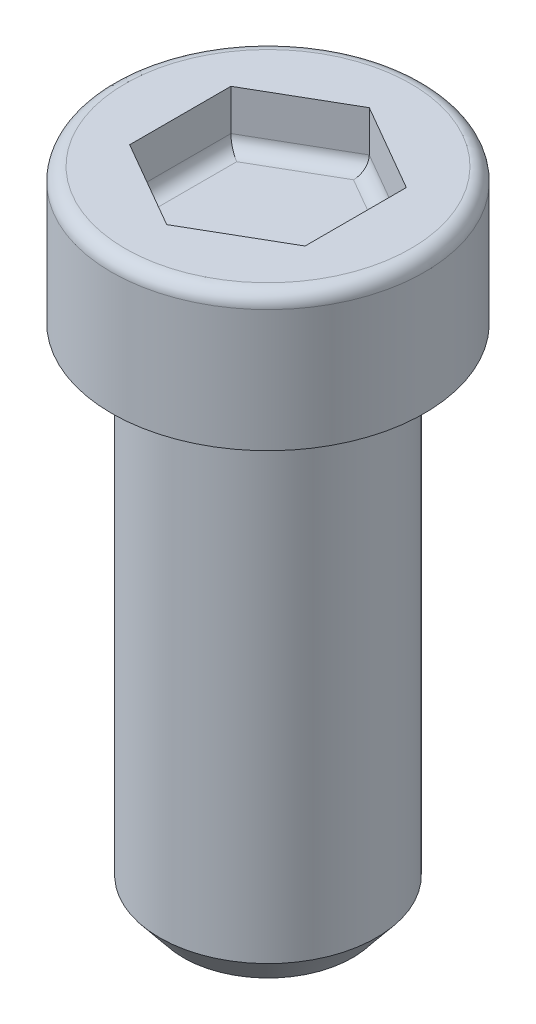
ISO-10303-21;
HEADER;
FILE_DESCRIPTION(('STEP AP214'),'2;1');
FILE_NAME('part.step','',(''),(''),'','','');
FILE_SCHEMA(('AUTOMOTIVE_DESIGN { 1 0 10303 214 1 1 1 1 }'));
ENDSEC;
DATA;
#1=APPLICATION_CONTEXT('core data for automotive mechanical design processes');
#2=APPLICATION_PROTOCOL_DEFINITION('international standard','automotive_design',2000,#1);
#3=PRODUCT_CONTEXT('',#1,'mechanical');
#4=PRODUCT('Part','Part','',(#3));
#5=PRODUCT_RELATED_PRODUCT_CATEGORY('part','',(#4));
#6=PRODUCT_DEFINITION_FORMATION('','',#4);
#7=PRODUCT_DEFINITION_CONTEXT('part definition',#1,'design');
#8=PRODUCT_DEFINITION('design','',#6,#7);
#9=PRODUCT_DEFINITION_SHAPE('','',#8);
#10=(LENGTH_UNIT() NAMED_UNIT(*) SI_UNIT(.MILLI.,.METRE.));
#11=(NAMED_UNIT(*) PLANE_ANGLE_UNIT() SI_UNIT($,.RADIAN.));
#12=(NAMED_UNIT(*) SI_UNIT($,.STERADIAN.) SOLID_ANGLE_UNIT());
#13=UNCERTAINTY_MEASURE_WITH_UNIT(LENGTH_MEASURE(1.E-05),#10,'distance_accuracy_value','');
#14=(GEOMETRIC_REPRESENTATION_CONTEXT(3) GLOBAL_UNCERTAINTY_ASSIGNED_CONTEXT((#13)) GLOBAL_UNIT_ASSIGNED_CONTEXT((#10,
#11,#12)) REPRESENTATION_CONTEXT('',''));
#15=CARTESIAN_POINT('',(0.,0.,0.));
#16=DIRECTION('',(0.,0.,1.));
#17=DIRECTION('',(1.,0.,0.));
#18=AXIS2_PLACEMENT_3D('',#15,#16,#17);
#19=CARTESIAN_POINT('',(-222.928713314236,-20.1336273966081,49.9999999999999));
#20=DIRECTION('',(0.,-1.,0.));
#21=DIRECTION('',(0.,0.,-1.));
#22=AXIS2_PLACEMENT_3D('',#19,#20,#21);
#23=PLANE('',#22);
#24=DIRECTION('',(-0.866025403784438,0.,0.500000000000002));
#25=VECTOR('',#24,1.);
#26=CARTESIAN_POINT('',(-222.928713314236,-20.1336273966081,46.2890544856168));
#27=LINE('',#26,#25);
#28=CARTESIAN_POINT('',(-222.928713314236,-20.1336273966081,46.2890544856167));
#29=VERTEX_POINT('',#28);
#30=CARTESIAN_POINT('',(-226.142486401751,-20.1336273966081,48.1445272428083));
#31=VERTEX_POINT('',#30);
#32=EDGE_CURVE('E114',#29,#31,#27,.T.);
#33=ORIENTED_EDGE('',*,*,#32,.F.);
#34=DIRECTION('',(-0.866025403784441,0.,-0.499999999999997));
#35=VECTOR('',#34,1.);
#36=CARTESIAN_POINT('',(-219.71494022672,-20.1336273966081,48.1445272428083));
#37=LINE('',#36,#35);
#38=CARTESIAN_POINT('',(-219.71494022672,-20.1336273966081,48.1445272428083));
#39=VERTEX_POINT('',#38);
#40=EDGE_CURVE('E119',#39,#29,#37,.T.);
#41=ORIENTED_EDGE('',*,*,#40,.F.);
#42=DIRECTION('',(0.,0.,-1.));
#43=VECTOR('',#42,1.);
#44=CARTESIAN_POINT('',(-219.71494022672,-20.1336273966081,51.8554727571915));
#45=LINE('',#44,#43);
#46=CARTESIAN_POINT('',(-219.71494022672,-20.1336273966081,51.8554727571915));
#47=VERTEX_POINT('',#46);
#48=EDGE_CURVE('E132',#47,#39,#45,.T.);
#49=ORIENTED_EDGE('',*,*,#48,.F.);
#50=DIRECTION('',(0.866025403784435,0.,-0.500000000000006));
#51=VECTOR('',#50,1.);
#52=CARTESIAN_POINT('',(-222.928713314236,-20.1336273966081,53.7109455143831));
#53=LINE('',#52,#51);
#54=CARTESIAN_POINT('',(-222.928713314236,-20.1336273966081,53.7109455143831));
#55=VERTEX_POINT('',#54);
#56=EDGE_CURVE('E126',#55,#47,#53,.T.);
#57=ORIENTED_EDGE('',*,*,#56,.F.);
#58=DIRECTION('',(0.866025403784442,0.,0.499999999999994));
#59=VECTOR('',#58,1.);
#60=CARTESIAN_POINT('',(-226.142486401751,-20.1336273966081,51.8554727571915));
#61=LINE('',#60,#59);
#62=CARTESIAN_POINT('',(-226.142486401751,-20.1336273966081,51.8554727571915));
#63=VERTEX_POINT('',#62);
#64=EDGE_CURVE('E124',#63,#55,#61,.T.);
#65=ORIENTED_EDGE('',*,*,#64,.F.);
#66=DIRECTION('',(0.,0.,1.));
#67=VECTOR('',#66,1.);
#68=CARTESIAN_POINT('',(-226.142486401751,-20.1336273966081,48.1445272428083));
#69=LINE('',#68,#67);
#70=EDGE_CURVE('E107',#31,#63,#69,.T.);
#71=ORIENTED_EDGE('',*,*,#70,.F.);
#72=EDGE_LOOP('',(#33,#41,#49,#57,#65,#71));
#73=FACE_BOUND('',#72,.T.);
#74=CARTESIAN_POINT('',(-222.928713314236,-20.1336273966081,49.9999999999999));
#75=DIRECTION('',(0.,1.,0.));
#76=DIRECTION('',(0.,0.,1.));
#77=AXIS2_PLACEMENT_3D('',#74,#75,#76);
#78=CIRCLE('',#77,5.23387796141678);
#79=CARTESIAN_POINT('',(-222.928713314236,-20.1336273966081,55.2338779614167));
#80=VERTEX_POINT('',#79);
#81=EDGE_CURVE('E158',#80,#80,#78,.T.);
#82=ORIENTED_EDGE('',*,*,#81,.T.);
#83=EDGE_LOOP('',(#82));
#84=FACE_BOUND('',#83,.T.);
#85=ADVANCED_FACE('F33',(#73,#84),#23,.F.);
#86=CARTESIAN_POINT('',(-222.928713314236,-20.6336273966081,49.9999999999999));
#87=DIRECTION('',(0.,1.,0.));
#88=DIRECTION('',(0.,0.,1.));
#89=AXIS2_PLACEMENT_3D('',#86,#87,#88);
#90=TOROIDAL_SURFACE('',#89,5.23387796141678,0.5);
#91=ORIENTED_EDGE('',*,*,#81,.F.);
#92=EDGE_LOOP('',(#91));
#93=FACE_BOUND('',#92,.T.);
#94=CARTESIAN_POINT('',(-222.928713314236,-20.6336273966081,49.9999999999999));
#95=DIRECTION('',(0.,1.,0.));
#96=DIRECTION('',(0.,0.,1.));
#97=AXIS2_PLACEMENT_3D('',#94,#95,#96);
#98=CIRCLE('',#97,5.73387796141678);
#99=CARTESIAN_POINT('',(-222.928713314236,-20.6336273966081,55.7338779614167));
#100=VERTEX_POINT('',#99);
#101=EDGE_CURVE('E155',#100,#100,#98,.T.);
#102=ORIENTED_EDGE('',*,*,#101,.T.);
#103=EDGE_LOOP('',(#102));
#104=FACE_BOUND('',#103,.T.);
#105=ADVANCED_FACE('F244',(#93,#104),#90,.T.);
#106=CARTESIAN_POINT('',(-222.928713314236,-25.1108396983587,49.9999999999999));
#107=DIRECTION('',(0.,1.,0.));
#108=DIRECTION('',(0.,0.,1.));
#109=AXIS2_PLACEMENT_3D('',#106,#107,#108);
#110=CYLINDRICAL_SURFACE('',#109,5.73387796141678);
#111=ORIENTED_EDGE('',*,*,#101,.F.);
#112=EDGE_LOOP('',(#111));
#113=FACE_BOUND('',#112,.T.);
#114=CARTESIAN_POINT('',(-222.928713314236,-25.1108396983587,49.9999999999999));
#115=DIRECTION('',(0.,1.,0.));
#116=DIRECTION('',(0.,0.,1.));
#117=AXIS2_PLACEMENT_3D('',#114,#115,#116);
#118=CIRCLE('',#117,5.73387796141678);
#119=CARTESIAN_POINT('',(-222.928713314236,-25.1108396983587,55.7338779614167));
#120=VERTEX_POINT('',#119);
#121=EDGE_CURVE('E152',#120,#120,#118,.T.);
#122=ORIENTED_EDGE('',*,*,#121,.T.);
#123=EDGE_LOOP('',(#122));
#124=FACE_BOUND('',#123,.T.);
#125=ADVANCED_FACE('F249',(#113,#124),#110,.T.);
#126=CARTESIAN_POINT('',(-222.928713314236,-25.1108396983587,46.0254739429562));
#127=DIRECTION('',(0.,1.,0.));
#128=DIRECTION('',(0.,0.,1.));
#129=AXIS2_PLACEMENT_3D('',#126,#127,#128);
#130=PLANE('',#129);
#131=ORIENTED_EDGE('',*,*,#121,.F.);
#132=EDGE_LOOP('',(#131));
#133=FACE_BOUND('',#132,.T.);
#134=CARTESIAN_POINT('',(-222.928713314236,-25.1108396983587,49.9999999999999));
#135=DIRECTION('',(0.,1.,0.));
#136=DIRECTION('',(0.,0.,1.));
#137=AXIS2_PLACEMENT_3D('',#134,#135,#136);
#138=CIRCLE('',#137,3.97452605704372);
#139=CARTESIAN_POINT('',(-222.928713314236,-25.1108396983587,53.9745260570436));
#140=VERTEX_POINT('',#139);
#141=EDGE_CURVE('E149',#140,#140,#138,.T.);
#142=ORIENTED_EDGE('',*,*,#141,.T.);
#143=EDGE_LOOP('',(#142));
#144=FACE_BOUND('',#143,.T.);
#145=ADVANCED_FACE('F366',(#133,#144),#130,.F.);
#146=CARTESIAN_POINT('',(-222.928713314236,-25.1108396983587,49.9999999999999));
#147=DIRECTION('',(0.,1.,0.));
#148=DIRECTION('',(0.,0.,1.));
#149=AXIS2_PLACEMENT_3D('',#146,#147,#148);
#150=CYLINDRICAL_SURFACE('',#149,3.97452605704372);
#151=ORIENTED_EDGE('',*,*,#141,.F.);
#152=EDGE_LOOP('',(#151));
#153=FACE_BOUND('',#152,.T.);
#154=CARTESIAN_POINT('',(-222.928713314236,-42.6313885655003,49.9999999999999));
#155=DIRECTION('',(0.,1.,0.));
#156=DIRECTION('',(0.,0.,1.));
#157=AXIS2_PLACEMENT_3D('',#154,#155,#156);
#158=CIRCLE('',#157,3.97452605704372);
#159=CARTESIAN_POINT('',(-222.928713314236,-42.6313885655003,53.9745260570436));
#160=VERTEX_POINT('',#159);
#161=EDGE_CURVE('E146',#160,#160,#158,.T.);
#162=ORIENTED_EDGE('',*,*,#161,.T.);
#163=EDGE_LOOP('',(#162));
#164=FACE_BOUND('',#163,.T.);
#165=ADVANCED_FACE('F357',(#153,#164),#150,.T.);
#166=CARTESIAN_POINT('',(-222.928713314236,-43.7106883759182,49.9999999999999));
#167=DIRECTION('',(0.,1.,0.));
#168=DIRECTION('',(0.,0.,1.));
#169=AXIS2_PLACEMENT_3D('',#166,#167,#168);
#170=CONICAL_SURFACE('',#169,3.09540735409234,0.683536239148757);
#171=ORIENTED_EDGE('',*,*,#161,.F.);
#172=EDGE_LOOP('',(#171));
#173=FACE_BOUND('',#172,.T.);
#174=CARTESIAN_POINT('',(-222.928713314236,-43.7106883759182,49.9999999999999));
#175=DIRECTION('',(0.,1.,0.));
#176=DIRECTION('',(0.,0.,1.));
#177=AXIS2_PLACEMENT_3D('',#174,#175,#176);
#178=CIRCLE('',#177,3.09540735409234);
#179=CARTESIAN_POINT('',(-222.928713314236,-43.7106883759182,53.0954073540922));
#180=VERTEX_POINT('',#179);
#181=EDGE_CURVE('E137',#180,#180,#178,.T.);
#182=ORIENTED_EDGE('',*,*,#181,.T.);
#183=EDGE_LOOP('',(#182));
#184=FACE_BOUND('',#183,.T.);
#185=ADVANCED_FACE('F348',(#173,#184),#170,.T.);
#186=CARTESIAN_POINT('',(-222.928713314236,-43.7106883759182,49.9999999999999));
#187=DIRECTION('',(0.,1.,0.));
#188=DIRECTION('',(0.,0.,1.));
#189=AXIS2_PLACEMENT_3D('',#186,#187,#188);
#190=PLANE('',#189);
#191=ORIENTED_EDGE('',*,*,#181,.F.);
#192=EDGE_LOOP('',(#191));
#193=FACE_BOUND('',#192,.T.);
#194=ADVANCED_FACE('F340',(#193),#190,.F.);
#195=CARTESIAN_POINT('',(-219.71494022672,-22.1336273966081,48.1445272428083));
#196=DIRECTION('',(0.499999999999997,0.,-0.866025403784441));
#197=DIRECTION('',(-0.866025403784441,0.,-0.499999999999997));
#198=AXIS2_PLACEMENT_3D('',#195,#196,#197);
#199=PLANE('',#198);
#200=DIRECTION('',(0.,1.,0.));
#201=VECTOR('',#200,1.);
#202=CARTESIAN_POINT('',(-222.928713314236,-22.1336273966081,46.2890544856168));
#203=LINE('',#202,#201);
#204=CARTESIAN_POINT('',(-222.928713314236,-21.6336273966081,46.2890544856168));
#205=VERTEX_POINT('',#204);
#206=EDGE_CURVE('E111',#205,#29,#203,.T.);
#207=ORIENTED_EDGE('',*,*,#206,.F.);
#208=DIRECTION('',(-0.866025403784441,0.,-0.499999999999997));
#209=VECTOR('',#208,1.);
#210=CARTESIAN_POINT('',(-219.71494022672,-21.6336273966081,48.1445272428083));
#211=LINE('',#210,#209);
#212=CARTESIAN_POINT('',(-219.71494022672,-21.6336273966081,48.1445272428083));
#213=VERTEX_POINT('',#212);
#214=EDGE_CURVE('E11',#205,#213,#211,.F.);
#215=ORIENTED_EDGE('',*,*,#214,.T.);
#216=DIRECTION('',(0.,1.,0.));
#217=VECTOR('',#216,1.);
#218=CARTESIAN_POINT('',(-219.71494022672,-22.1336273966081,48.1445272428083));
#219=LINE('',#218,#217);
#220=EDGE_CURVE('E135',#213,#39,#219,.T.);
#221=ORIENTED_EDGE('',*,*,#220,.T.);
#222=ORIENTED_EDGE('',*,*,#40,.T.);
#223=EDGE_LOOP('',(#207,#215,#221,#222));
#224=FACE_BOUND('',#223,.T.);
#225=ADVANCED_FACE('F202',(#224),#199,.F.);
#226=CARTESIAN_POINT('',(-219.71494022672,-22.1336273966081,51.8554727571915));
#227=DIRECTION('',(1.,0.,0.));
#228=DIRECTION('',(0.,0.,-1.));
#229=AXIS2_PLACEMENT_3D('',#226,#227,#228);
#230=PLANE('',#229);
#231=ORIENTED_EDGE('',*,*,#220,.F.);
#232=DIRECTION('',(0.,0.,-1.));
#233=VECTOR('',#232,1.);
#234=CARTESIAN_POINT('',(-219.71494022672,-21.6336273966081,51.8554727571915));
#235=LINE('',#234,#233);
#236=CARTESIAN_POINT('',(-219.71494022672,-21.6336273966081,51.8554727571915));
#237=VERTEX_POINT('',#236);
#238=EDGE_CURVE('E174',#213,#237,#235,.F.);
#239=ORIENTED_EDGE('',*,*,#238,.T.);
#240=DIRECTION('',(0.,1.,0.));
#241=VECTOR('',#240,1.);
#242=CARTESIAN_POINT('',(-219.71494022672,-22.1336273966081,51.8554727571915));
#243=LINE('',#242,#241);
#244=EDGE_CURVE('E138',#237,#47,#243,.T.);
#245=ORIENTED_EDGE('',*,*,#244,.T.);
#246=ORIENTED_EDGE('',*,*,#48,.T.);
#247=EDGE_LOOP('',(#231,#239,#245,#246));
#248=FACE_BOUND('',#247,.T.);
#249=ADVANCED_FACE('F207',(#248),#230,.F.);
#250=CARTESIAN_POINT('',(-222.928713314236,-22.1336273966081,53.7109455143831));
#251=DIRECTION('',(0.500000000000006,0.,0.866025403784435));
#252=DIRECTION('',(0.866025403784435,0.,-0.500000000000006));
#253=AXIS2_PLACEMENT_3D('',#250,#251,#252);
#254=PLANE('',#253);
#255=ORIENTED_EDGE('',*,*,#244,.F.);
#256=DIRECTION('',(0.866025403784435,0.,-0.500000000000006));
#257=VECTOR('',#256,1.);
#258=CARTESIAN_POINT('',(-222.928713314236,-21.6336273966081,53.7109455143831));
#259=LINE('',#258,#257);
#260=CARTESIAN_POINT('',(-222.928713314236,-21.6336273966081,53.7109455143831));
#261=VERTEX_POINT('',#260);
#262=EDGE_CURVE('E177',#237,#261,#259,.F.);
#263=ORIENTED_EDGE('',*,*,#262,.T.);
#264=DIRECTION('',(0.,1.,0.));
#265=VECTOR('',#264,1.);
#266=CARTESIAN_POINT('',(-222.928713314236,-22.1336273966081,53.7109455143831));
#267=LINE('',#266,#265);
#268=EDGE_CURVE('E140',#261,#55,#267,.T.);
#269=ORIENTED_EDGE('',*,*,#268,.T.);
#270=ORIENTED_EDGE('',*,*,#56,.T.);
#271=EDGE_LOOP('',(#255,#263,#269,#270));
#272=FACE_BOUND('',#271,.T.);
#273=ADVANCED_FACE('F211',(#272),#254,.F.);
#274=CARTESIAN_POINT('',(-226.142486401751,-22.1336273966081,51.8554727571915));
#275=DIRECTION('',(-0.499999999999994,0.,0.866025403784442));
#276=DIRECTION('',(0.866025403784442,0.,0.499999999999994));
#277=AXIS2_PLACEMENT_3D('',#274,#275,#276);
#278=PLANE('',#277);
#279=ORIENTED_EDGE('',*,*,#268,.F.);
#280=DIRECTION('',(0.866025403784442,0.,0.499999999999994));
#281=VECTOR('',#280,1.);
#282=CARTESIAN_POINT('',(-226.142486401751,-21.6336273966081,51.8554727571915));
#283=LINE('',#282,#281);
#284=CARTESIAN_POINT('',(-226.142486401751,-21.6336273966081,51.8554727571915));
#285=VERTEX_POINT('',#284);
#286=EDGE_CURVE('E179',#261,#285,#283,.F.);
#287=ORIENTED_EDGE('',*,*,#286,.T.);
#288=DIRECTION('',(0.,1.,0.));
#289=VECTOR('',#288,1.);
#290=CARTESIAN_POINT('',(-226.142486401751,-22.1336273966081,51.8554727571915));
#291=LINE('',#290,#289);
#292=EDGE_CURVE('E110',#285,#63,#291,.T.);
#293=ORIENTED_EDGE('',*,*,#292,.T.);
#294=ORIENTED_EDGE('',*,*,#64,.T.);
#295=EDGE_LOOP('',(#279,#287,#293,#294));
#296=FACE_BOUND('',#295,.T.);
#297=ADVANCED_FACE('F215',(#296),#278,.F.);
#298=CARTESIAN_POINT('',(-226.142486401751,-22.1336273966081,48.1445272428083));
#299=DIRECTION('',(-1.,0.,0.));
#300=DIRECTION('',(0.,0.,1.));
#301=AXIS2_PLACEMENT_3D('',#298,#299,#300);
#302=PLANE('',#301);
#303=ORIENTED_EDGE('',*,*,#292,.F.);
#304=DIRECTION('',(0.,0.,1.));
#305=VECTOR('',#304,1.);
#306=CARTESIAN_POINT('',(-226.142486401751,-21.6336273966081,48.1445272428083));
#307=LINE('',#306,#305);
#308=CARTESIAN_POINT('',(-226.142486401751,-21.6336273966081,48.1445272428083));
#309=VERTEX_POINT('',#308);
#310=EDGE_CURVE('E57',#285,#309,#307,.F.);
#311=ORIENTED_EDGE('',*,*,#310,.T.);
#312=DIRECTION('',(0.,1.,0.));
#313=VECTOR('',#312,1.);
#314=CARTESIAN_POINT('',(-226.142486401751,-22.1336273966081,48.1445272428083));
#315=LINE('',#314,#313);
#316=EDGE_CURVE('E103',#309,#31,#315,.T.);
#317=ORIENTED_EDGE('',*,*,#316,.T.);
#318=ORIENTED_EDGE('',*,*,#70,.T.);
#319=EDGE_LOOP('',(#303,#311,#317,#318));
#320=FACE_BOUND('',#319,.T.);
#321=ADVANCED_FACE('F105',(#320),#302,.F.);
#322=CARTESIAN_POINT('',(-222.928713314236,-22.1336273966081,46.2890544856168));
#323=DIRECTION('',(-0.500000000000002,0.,-0.866025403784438));
#324=DIRECTION('',(-0.866025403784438,0.,0.500000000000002));
#325=AXIS2_PLACEMENT_3D('',#322,#323,#324);
#326=PLANE('',#325);
#327=ORIENTED_EDGE('',*,*,#316,.F.);
#328=DIRECTION('',(-0.866025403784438,0.,0.500000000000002));
#329=VECTOR('',#328,1.);
#330=CARTESIAN_POINT('',(-222.928713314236,-21.6336273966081,46.2890544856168));
#331=LINE('',#330,#329);
#332=EDGE_CURVE('E42',#309,#205,#331,.F.);
#333=ORIENTED_EDGE('',*,*,#332,.T.);
#334=ORIENTED_EDGE('',*,*,#206,.T.);
#335=ORIENTED_EDGE('',*,*,#32,.T.);
#336=EDGE_LOOP('',(#327,#333,#334,#335));
#337=FACE_BOUND('',#336,.T.);
#338=ADVANCED_FACE('F115',(#337),#326,.F.);
#339=CARTESIAN_POINT('',(-222.928713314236,-22.1336273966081,46.2890544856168));
#340=DIRECTION('',(0.,1.,0.));
#341=DIRECTION('',(0.,0.,1.));
#342=AXIS2_PLACEMENT_3D('',#339,#340,#341);
#343=PLANE('',#342);
#344=DIRECTION('',(0.866025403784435,0.,-0.500000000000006));
#345=VECTOR('',#344,1.);
#346=CARTESIAN_POINT('',(-219.96494022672,-22.1336273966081,51.4224600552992));
#347=LINE('',#346,#345);
#348=CARTESIAN_POINT('',(-222.928713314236,-22.1336273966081,53.1335952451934));
#349=VERTEX_POINT('',#348);
#350=CARTESIAN_POINT('',(-220.21494022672,-22.1336273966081,51.5667976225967));
#351=VERTEX_POINT('',#350);
#352=EDGE_CURVE('E169',#349,#351,#347,.T.);
#353=ORIENTED_EDGE('',*,*,#352,.T.);
#354=DIRECTION('',(0.,0.,-1.));
#355=VECTOR('',#354,1.);
#356=CARTESIAN_POINT('',(-220.21494022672,-22.1336273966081,46.2890544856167));
#357=LINE('',#356,#355);
#358=CARTESIAN_POINT('',(-220.21494022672,-22.1336273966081,48.4332023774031));
#359=VERTEX_POINT('',#358);
#360=EDGE_CURVE('E171',#351,#359,#357,.T.);
#361=ORIENTED_EDGE('',*,*,#360,.T.);
#362=DIRECTION('',(-0.866025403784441,0.,-0.499999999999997));
#363=VECTOR('',#362,1.);
#364=CARTESIAN_POINT('',(-223.178713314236,-22.1336273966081,46.722067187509));
#365=LINE('',#364,#363);
#366=CARTESIAN_POINT('',(-222.928713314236,-22.1336273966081,46.8664047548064));
#367=VERTEX_POINT('',#366);
#368=EDGE_CURVE('E161',#359,#367,#365,.T.);
#369=ORIENTED_EDGE('',*,*,#368,.T.);
#370=DIRECTION('',(-0.866025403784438,0.,0.500000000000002));
#371=VECTOR('',#370,1.);
#372=CARTESIAN_POINT('',(-222.678713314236,-22.1336273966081,46.722067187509));
#373=LINE('',#372,#371);
#374=CARTESIAN_POINT('',(-225.642486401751,-22.1336273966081,48.4332023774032));
#375=VERTEX_POINT('',#374);
#376=EDGE_CURVE('E163',#367,#375,#373,.T.);
#377=ORIENTED_EDGE('',*,*,#376,.T.);
#378=DIRECTION('',(0.,0.,1.));
#379=VECTOR('',#378,1.);
#380=CARTESIAN_POINT('',(-225.642486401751,-22.1336273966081,46.2890544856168));
#381=LINE('',#380,#379);
#382=CARTESIAN_POINT('',(-225.642486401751,-22.1336273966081,51.5667976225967));
#383=VERTEX_POINT('',#382);
#384=EDGE_CURVE('E165',#375,#383,#381,.T.);
#385=ORIENTED_EDGE('',*,*,#384,.T.);
#386=DIRECTION('',(0.866025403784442,0.,0.499999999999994));
#387=VECTOR('',#386,1.);
#388=CARTESIAN_POINT('',(-225.892486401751,-22.1336273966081,51.4224600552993));
#389=LINE('',#388,#387);
#390=EDGE_CURVE('E167',#383,#349,#389,.T.);
#391=ORIENTED_EDGE('',*,*,#390,.T.);
#392=EDGE_LOOP('',(#353,#361,#369,#377,#385,#391));
#393=FACE_BOUND('',#392,.T.);
#394=ADVANCED_FACE('F234',(#393),#343,.T.);
#395=CARTESIAN_POINT('',(-225.642486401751,-21.6336273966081,46.2890544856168));
#396=DIRECTION('',(0.,0.,1.));
#397=DIRECTION('',(1.,0.,0.));
#398=AXIS2_PLACEMENT_3D('',#395,#396,#397);
#399=CYLINDRICAL_SURFACE('',#398,0.5);
#400=CARTESIAN_POINT('',(-225.642486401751,-21.6336273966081,48.4332023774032));
#401=DIRECTION('',(-0.499999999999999,0.,0.866025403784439));
#402=DIRECTION('',(0.866025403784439,0.,0.499999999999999));
#403=AXIS2_PLACEMENT_3D('',#400,#401,#402);
#404=ELLIPSE('',#403,0.577350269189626,0.5);
#405=EDGE_CURVE('E192',#309,#375,#404,.T.);
#406=ORIENTED_EDGE('',*,*,#405,.F.);
#407=ORIENTED_EDGE('',*,*,#310,.F.);
#408=CARTESIAN_POINT('',(-225.642486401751,-21.6336273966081,51.5667976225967));
#409=DIRECTION('',(0.500000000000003,0.,0.866025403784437));
#410=DIRECTION('',(0.866025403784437,0.,-0.500000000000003));
#411=AXIS2_PLACEMENT_3D('',#408,#409,#410);
#412=ELLIPSE('',#411,0.577350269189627,0.5);
#413=EDGE_CURVE('E37',#383,#285,#412,.F.);
#414=ORIENTED_EDGE('',*,*,#413,.F.);
#415=ORIENTED_EDGE('',*,*,#384,.F.);
#416=EDGE_LOOP('',(#406,#407,#414,#415));
#417=FACE_BOUND('',#416,.T.);
#418=ADVANCED_FACE('F35',(#417),#399,.F.);
#419=CARTESIAN_POINT('',(-225.892486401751,-21.6336273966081,51.4224600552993));
#420=DIRECTION('',(0.866025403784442,0.,0.499999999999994));
#421=DIRECTION('',(0.499999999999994,0.,-0.866025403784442));
#422=AXIS2_PLACEMENT_3D('',#419,#420,#421);
#423=CYLINDRICAL_SURFACE('',#422,0.5);
#424=ORIENTED_EDGE('',*,*,#413,.T.);
#425=ORIENTED_EDGE('',*,*,#286,.F.);
#426=CARTESIAN_POINT('',(-222.928713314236,-21.6336273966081,53.1335952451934));
#427=DIRECTION('',(1.,0.,0.));
#428=DIRECTION('',(0.,0.,-1.));
#429=AXIS2_PLACEMENT_3D('',#426,#427,#428);
#430=ELLIPSE('',#429,0.577350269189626,0.5);
#431=EDGE_CURVE('E190',#349,#261,#430,.F.);
#432=ORIENTED_EDGE('',*,*,#431,.F.);
#433=ORIENTED_EDGE('',*,*,#390,.F.);
#434=EDGE_LOOP('',(#424,#425,#432,#433));
#435=FACE_BOUND('',#434,.T.);
#436=ADVANCED_FACE('F232',(#435),#423,.F.);
#437=CARTESIAN_POINT('',(-222.678713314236,-21.6336273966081,46.722067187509));
#438=DIRECTION('',(-0.866025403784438,0.,0.500000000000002));
#439=DIRECTION('',(0.500000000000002,0.,0.866025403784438));
#440=AXIS2_PLACEMENT_3D('',#437,#438,#439);
#441=CYLINDRICAL_SURFACE('',#440,0.5);
#442=ORIENTED_EDGE('',*,*,#405,.T.);
#443=ORIENTED_EDGE('',*,*,#376,.F.);
#444=CARTESIAN_POINT('',(-222.928713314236,-21.6336273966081,46.8664047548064));
#445=DIRECTION('',(-1.,0.,0.));
#446=DIRECTION('',(0.,0.,1.));
#447=AXIS2_PLACEMENT_3D('',#444,#445,#446);
#448=ELLIPSE('',#447,0.577350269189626,0.5);
#449=EDGE_CURVE('E187',#205,#367,#448,.T.);
#450=ORIENTED_EDGE('',*,*,#449,.F.);
#451=ORIENTED_EDGE('',*,*,#332,.F.);
#452=EDGE_LOOP('',(#442,#443,#450,#451));
#453=FACE_BOUND('',#452,.T.);
#454=ADVANCED_FACE('F218',(#453),#441,.F.);
#455=CARTESIAN_POINT('',(-219.96494022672,-21.6336273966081,51.4224600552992));
#456=DIRECTION('',(0.866025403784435,0.,-0.500000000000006));
#457=DIRECTION('',(-0.500000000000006,0.,-0.866025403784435));
#458=AXIS2_PLACEMENT_3D('',#455,#456,#457);
#459=CYLINDRICAL_SURFACE('',#458,0.5);
#460=ORIENTED_EDGE('',*,*,#431,.T.);
#461=ORIENTED_EDGE('',*,*,#262,.F.);
#462=CARTESIAN_POINT('',(-220.21494022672,-21.6336273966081,51.5667976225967));
#463=DIRECTION('',(0.499999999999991,0.,-0.866025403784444));
#464=DIRECTION('',(-0.866025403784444,0.,-0.499999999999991));
#465=AXIS2_PLACEMENT_3D('',#462,#463,#464);
#466=ELLIPSE('',#465,0.577350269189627,0.5);
#467=EDGE_CURVE('E185',#351,#237,#466,.F.);
#468=ORIENTED_EDGE('',*,*,#467,.F.);
#469=ORIENTED_EDGE('',*,*,#352,.F.);
#470=EDGE_LOOP('',(#460,#461,#468,#469));
#471=FACE_BOUND('',#470,.T.);
#472=ADVANCED_FACE('F230',(#471),#459,.F.);
#473=CARTESIAN_POINT('',(-223.178713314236,-21.6336273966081,46.722067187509));
#474=DIRECTION('',(-0.866025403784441,0.,-0.499999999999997));
#475=DIRECTION('',(-0.499999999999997,0.,0.866025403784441));
#476=AXIS2_PLACEMENT_3D('',#473,#474,#475);
#477=CYLINDRICAL_SURFACE('',#476,0.5);
#478=ORIENTED_EDGE('',*,*,#449,.T.);
#479=ORIENTED_EDGE('',*,*,#368,.F.);
#480=CARTESIAN_POINT('',(-220.21494022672,-21.6336273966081,48.4332023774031));
#481=DIRECTION('',(-0.500000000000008,0.,-0.866025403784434));
#482=DIRECTION('',(0.866025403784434,0.,-0.500000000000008));
#483=AXIS2_PLACEMENT_3D('',#480,#481,#482);
#484=ELLIPSE('',#483,0.577350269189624,0.5);
#485=EDGE_CURVE('E183',#213,#359,#484,.T.);
#486=ORIENTED_EDGE('',*,*,#485,.F.);
#487=ORIENTED_EDGE('',*,*,#214,.F.);
#488=EDGE_LOOP('',(#478,#479,#486,#487));
#489=FACE_BOUND('',#488,.T.);
#490=ADVANCED_FACE('F223',(#489),#477,.F.);
#491=CARTESIAN_POINT('',(-220.21494022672,-21.6336273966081,46.2890544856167));
#492=DIRECTION('',(0.,0.,-1.));
#493=DIRECTION('',(-1.,0.,0.));
#494=AXIS2_PLACEMENT_3D('',#491,#492,#493);
#495=CYLINDRICAL_SURFACE('',#494,0.5);
#496=ORIENTED_EDGE('',*,*,#467,.T.);
#497=ORIENTED_EDGE('',*,*,#238,.F.);
#498=ORIENTED_EDGE('',*,*,#485,.T.);
#499=ORIENTED_EDGE('',*,*,#360,.F.);
#500=EDGE_LOOP('',(#496,#497,#498,#499));
#501=FACE_BOUND('',#500,.T.);
#502=ADVANCED_FACE('F226',(#501),#495,.F.);
#503=CLOSED_SHELL('',(#85,#105,#125,#145,#165,#185,#194,#225,#249,#273,#297,#321,#338,#394,#418,
#436,#454,#472,#490,#502));
#504=MANIFOLD_SOLID_BREP('B2',#503);
#505=ADVANCED_BREP_SHAPE_REPRESENTATION('',(#18,#504),#14);
#506=SHAPE_DEFINITION_REPRESENTATION(#9,#505);
ENDSEC;
END-ISO-10303-21;
